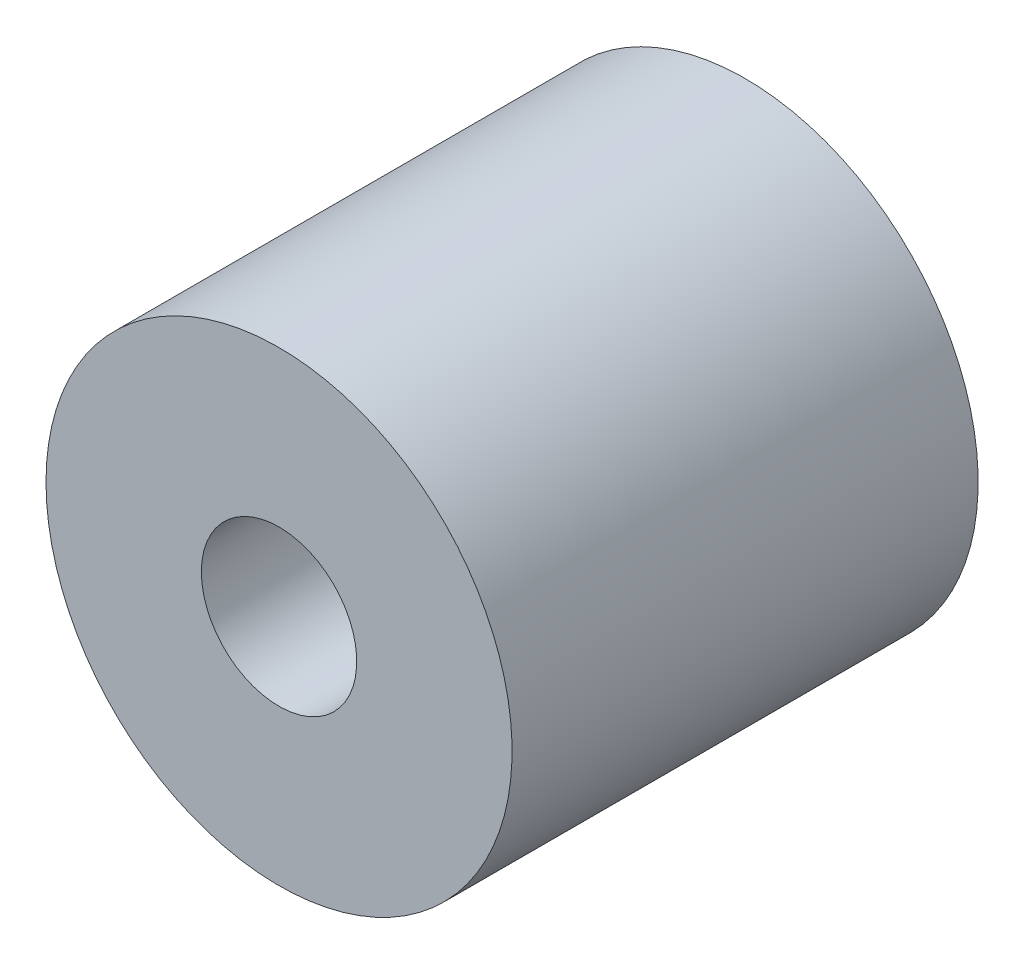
ISO-10303-21;
HEADER;
FILE_DESCRIPTION(('STEP AP214'),'2;1');
FILE_NAME('part.step','',(''),(''),'','','');
FILE_SCHEMA(('AUTOMOTIVE_DESIGN { 1 0 10303 214 1 1 1 1 }'));
ENDSEC;
DATA;
#1=APPLICATION_CONTEXT('core data for automotive mechanical design processes');
#2=APPLICATION_PROTOCOL_DEFINITION('international standard','automotive_design',2000,#1);
#3=PRODUCT_CONTEXT('',#1,'mechanical');
#4=PRODUCT('Part','Part','',(#3));
#5=PRODUCT_RELATED_PRODUCT_CATEGORY('part','',(#4));
#6=PRODUCT_DEFINITION_FORMATION('','',#4);
#7=PRODUCT_DEFINITION_CONTEXT('part definition',#1,'design');
#8=PRODUCT_DEFINITION('design','',#6,#7);
#9=PRODUCT_DEFINITION_SHAPE('','',#8);
#10=(LENGTH_UNIT() NAMED_UNIT(*) SI_UNIT(.MILLI.,.METRE.));
#11=(NAMED_UNIT(*) PLANE_ANGLE_UNIT() SI_UNIT($,.RADIAN.));
#12=(NAMED_UNIT(*) SI_UNIT($,.STERADIAN.) SOLID_ANGLE_UNIT());
#13=UNCERTAINTY_MEASURE_WITH_UNIT(LENGTH_MEASURE(1.E-05),#10,'distance_accuracy_value','');
#14=(GEOMETRIC_REPRESENTATION_CONTEXT(3) GLOBAL_UNCERTAINTY_ASSIGNED_CONTEXT((#13)) GLOBAL_UNIT_ASSIGNED_CONTEXT((#10,
#11,#12)) REPRESENTATION_CONTEXT('',''));
#15=CARTESIAN_POINT('',(0.,0.,0.));
#16=DIRECTION('',(0.,0.,1.));
#17=DIRECTION('',(1.,0.,0.));
#18=AXIS2_PLACEMENT_3D('',#15,#16,#17);
#19=CARTESIAN_POINT('',(0.,0.,15.));
#20=DIRECTION('',(0.,0.,-1.));
#21=DIRECTION('',(0.,-1.,0.));
#22=AXIS2_PLACEMENT_3D('',#19,#20,#21);
#23=PLANE('',#22);
#24=CARTESIAN_POINT('',(0.,0.,15.));
#25=DIRECTION('',(0.,0.,-1.));
#26=DIRECTION('',(1.,0.,0.));
#27=AXIS2_PLACEMENT_3D('',#24,#25,#26);
#28=CIRCLE('',#27,0.5);
#29=CARTESIAN_POINT('',(-0.5,0.,15.));
#30=VERTEX_POINT('',#29);
#31=EDGE_CURVE('E56',#30,#30,#28,.T.);
#32=ORIENTED_EDGE('',*,*,#31,.T.);
#33=EDGE_LOOP('',(#32));
#34=FACE_BOUND('',#33,.T.);
#35=CARTESIAN_POINT('',(0.,0.,15.));
#36=DIRECTION('',(0.,0.,1.));
#37=DIRECTION('',(1.,0.,0.));
#38=AXIS2_PLACEMENT_3D('',#35,#36,#37);
#39=CIRCLE('',#38,1.5);
#40=CARTESIAN_POINT('',(-1.5,0.,15.));
#41=VERTEX_POINT('',#40);
#42=EDGE_CURVE('E68',#41,#41,#39,.T.);
#43=ORIENTED_EDGE('',*,*,#42,.T.);
#44=EDGE_LOOP('',(#43));
#45=FACE_BOUND('',#44,.T.);
#46=ADVANCED_FACE('F16',(#34,#45),#23,.F.);
#47=CARTESIAN_POINT('',(0.,0.,12.));
#48=DIRECTION('',(0.,0.,-1.));
#49=DIRECTION('',(0.,-1.,0.));
#50=AXIS2_PLACEMENT_3D('',#47,#48,#49);
#51=PLANE('',#50);
#52=CARTESIAN_POINT('',(0.,0.,12.));
#53=DIRECTION('',(0.,0.,1.));
#54=DIRECTION('',(1.,0.,0.));
#55=AXIS2_PLACEMENT_3D('',#52,#53,#54);
#56=CIRCLE('',#55,0.5);
#57=CARTESIAN_POINT('',(-0.5,0.,12.));
#58=VERTEX_POINT('',#57);
#59=EDGE_CURVE('E57',#58,#58,#56,.T.);
#60=ORIENTED_EDGE('',*,*,#59,.T.);
#61=EDGE_LOOP('',(#60));
#62=FACE_BOUND('',#61,.T.);
#63=CARTESIAN_POINT('',(0.,0.,12.));
#64=DIRECTION('',(0.,0.,-1.));
#65=DIRECTION('',(1.,0.,0.));
#66=AXIS2_PLACEMENT_3D('',#63,#64,#65);
#67=CIRCLE('',#66,1.5);
#68=CARTESIAN_POINT('',(-1.5,0.,12.));
#69=VERTEX_POINT('',#68);
#70=EDGE_CURVE('E11',#69,#69,#67,.T.);
#71=ORIENTED_EDGE('',*,*,#70,.T.);
#72=EDGE_LOOP('',(#71));
#73=FACE_BOUND('',#72,.T.);
#74=ADVANCED_FACE('F74',(#62,#73),#51,.T.);
#75=CARTESIAN_POINT('',(0.,0.,12.));
#76=DIRECTION('',(0.,0.,1.));
#77=DIRECTION('',(1.,0.,0.));
#78=AXIS2_PLACEMENT_3D('',#75,#76,#77);
#79=CYLINDRICAL_SURFACE('',#78,1.5);
#80=ORIENTED_EDGE('',*,*,#42,.F.);
#81=DIRECTION('',(0.,0.,-1.));
#82=VECTOR('',#81,1.);
#83=CARTESIAN_POINT('',(-1.5,0.,12.));
#84=LINE('',#83,#82);
#85=EDGE_CURVE('E24',#41,#69,#84,.T.);
#86=ORIENTED_EDGE('',*,*,#85,.T.);
#87=ORIENTED_EDGE('',*,*,#70,.F.);
#88=ORIENTED_EDGE('',*,*,#85,.F.);
#89=EDGE_LOOP('',(#80,#86,#87,#88));
#90=FACE_BOUND('',#89,.T.);
#91=ADVANCED_FACE('F72',(#90),#79,.T.);
#92=CARTESIAN_POINT('',(0.,0.,12.));
#93=DIRECTION('',(0.,0.,1.));
#94=DIRECTION('',(1.,0.,0.));
#95=AXIS2_PLACEMENT_3D('',#92,#93,#94);
#96=CYLINDRICAL_SURFACE('',#95,0.5);
#97=ORIENTED_EDGE('',*,*,#31,.F.);
#98=DIRECTION('',(0.,0.,-1.));
#99=VECTOR('',#98,1.);
#100=CARTESIAN_POINT('',(-0.5,0.,12.));
#101=LINE('',#100,#99);
#102=EDGE_CURVE('E53',#30,#58,#101,.T.);
#103=ORIENTED_EDGE('',*,*,#102,.T.);
#104=ORIENTED_EDGE('',*,*,#59,.F.);
#105=ORIENTED_EDGE('',*,*,#102,.F.);
#106=EDGE_LOOP('',(#97,#103,#104,#105));
#107=FACE_BOUND('',#106,.T.);
#108=ADVANCED_FACE('F55',(#107),#96,.F.);
#109=CLOSED_SHELL('',(#46,#74,#91,#108));
#110=MANIFOLD_SOLID_BREP('B1',#109);
#111=ADVANCED_BREP_SHAPE_REPRESENTATION('',(#18,#110),#14);
#112=SHAPE_DEFINITION_REPRESENTATION(#9,#111);
ENDSEC;
END-ISO-10303-21;
